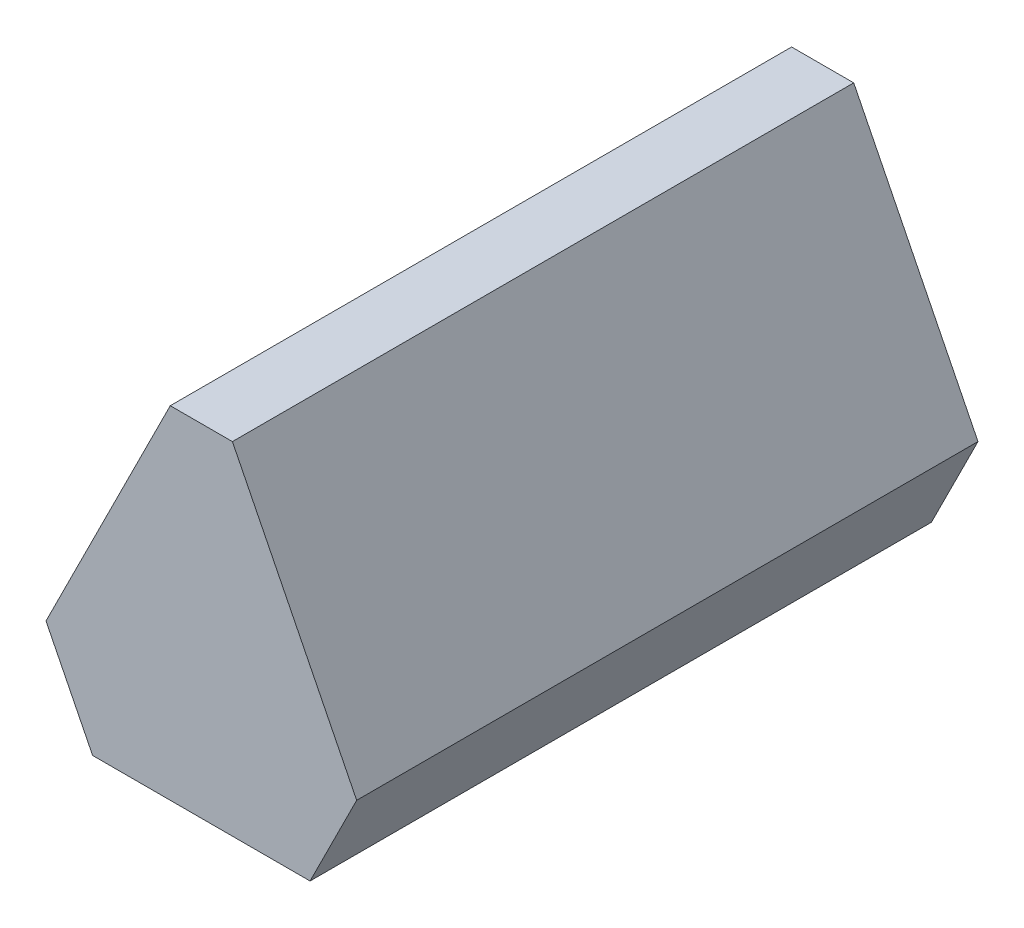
from build123d import *

# Parameters (mm, degrees)
BOSS_EXTRUDE1_DEPTH = 250


with BuildPart() as part:
    # Sketch1 → Boss-Extrude1 (new, symmetric)
    with BuildSketch(Plane.XY):
        Polygon((87.5, 0), (-87.5, 0), (-125, 75), (-25, 275), (25, 275), (125, 75), align=None)
    extrude(amount=BOSS_EXTRUDE1_DEPTH, both=True)


solid = part.part
